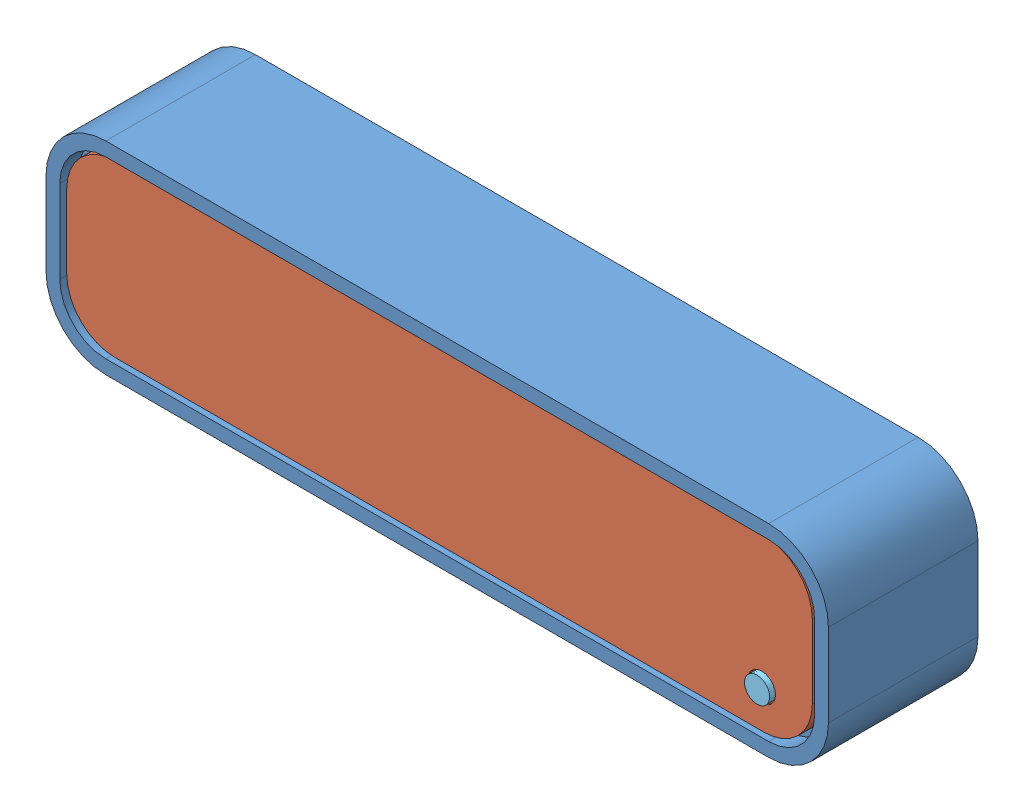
SolidWorks assembly Часики_02.SLDASM, configuration По умолчанию (file format 12000). Lengths in mm.
Overall size (170 44 32.5).
5 component instances, 5 part files, 14 mates.
Components (placement in the parent):
- PIPE_02-1: PIPE_02.SLDPRT [По умолчанию] at origin size (170 44 32.5)
- GLASS_02-1: GLASS_02.SLDPRT [По умолчанию] at (-0.5 -0.25 5) size (162 37 3)
- MATRIX_02-1: MATRIX_02.SLDPRT [По умолчанию] at (0 0 -10) size (140 32 25)
- BACK_02-2: BACK_02.SLDPRT [По умолчанию] at (-0.5 -0.25 -21) x (1 0 0) z (0 0 -1) size (162 37 2)
- BUTTON_02-1: BUTTON_02.SLDPRT [По умолчанию] at (69.5 -10.5 -7) x (1 0 0) z (0 -1 0) size (7.5 16 7.5)
Mates (geometry in assembly coordinates):
- Совпадение3: coincident anti-aligned: plane of PIPE_02-1 through (-66 16 -21) normal (0 -1 0); plane of MATRIX-1 through (-66 16 5) normal (0 1 0)
- Совпадение4: coincident anti-aligned: plane of PIPE_02-1 through (-66 16 -21) normal (1 0 0); plane of MATRIX-1 through (-66 16 5) normal (-1 0 0)
- Совпадение5: coincident aligned: plane of PIPE_02-1 through (-72 9 5) normal (0 0 1); plane of MATRIX-1 through (0 0 5) normal (0 0 1)
- Совпадение6: coincident anti-aligned: plane of PIPE_02-1 through (-72 -9 -21) normal (0 0 -1); plane of BACK-1 through (72 0 -30) normal (0 0 1)
- Совпадение7: coincident anti-aligned: plane of PIPE-1 through (-72 -19 -34) normal (0 1 0); plane of BACK-1 through (-72 -19 -30) normal (0 -1 0)
- Концентричный2: concentric anti-aligned: cylinder of PIPE-1 through (-72 0 -34) axis (0 0 1) radius 19; cylinder of BACK-1 through (-72 0 -30) axis (0 0 -1) radius 19
- Совпадение8: coincident anti-aligned: plane of PIPE_02-1 through (-72 -9 -21) normal (0 0 -1); plane of BACK_02-2 through (70 7.75 -21) normal (0 0 1)
- Расстояние2: distance = 0.25 mm anti-aligned: plane of GLASS_02-1 through (-71 -18.75 8) normal (0 -1 0); plane of PIPE_02-1 through (-72 -19 9) normal (0 1 0)
- Расстояние3: distance = 0.5 mm anti-aligned: plane of GLASS_02-1 through (-81.5 7.75 8) normal (-1 0 0); plane of PIPE_02-1 through (-82 9 9) normal (1 0 0)
- Расстояние4: distance = 0.25 mm anti-aligned: plane of BACK-2 through (-71 -18.75 -23) normal (0 -1 0); plane of PIPE_02-1 through (-72 -19 -23.5) normal (0 1 0)
- Расстояние5: distance = 0.5 mm anti-aligned: plane of BACK-2 through (-81.5 -8.25 -23) normal (-1 0 0); plane of PIPE_02-1 through (-82 -9 -23.5) normal (1 0 0)
- Совпадение9: coincident anti-aligned: plane of GLASS_02-1 through (70 -8.25 5) normal (0 0 -1); plane of BUTTON_02-1 through (69.5 -13.25 5) normal (0 0 1)
- Концентричный3: concentric aligned: circle of GLASS-1; circle of Кнопка-1
- Совпадение10: coincident anti-aligned: plane of PIPE_02-1 through (-72 9 5) normal (0 0 1); plane of GLASS_02-1 through (70 -8.25 5) normal (0 0 -1)
